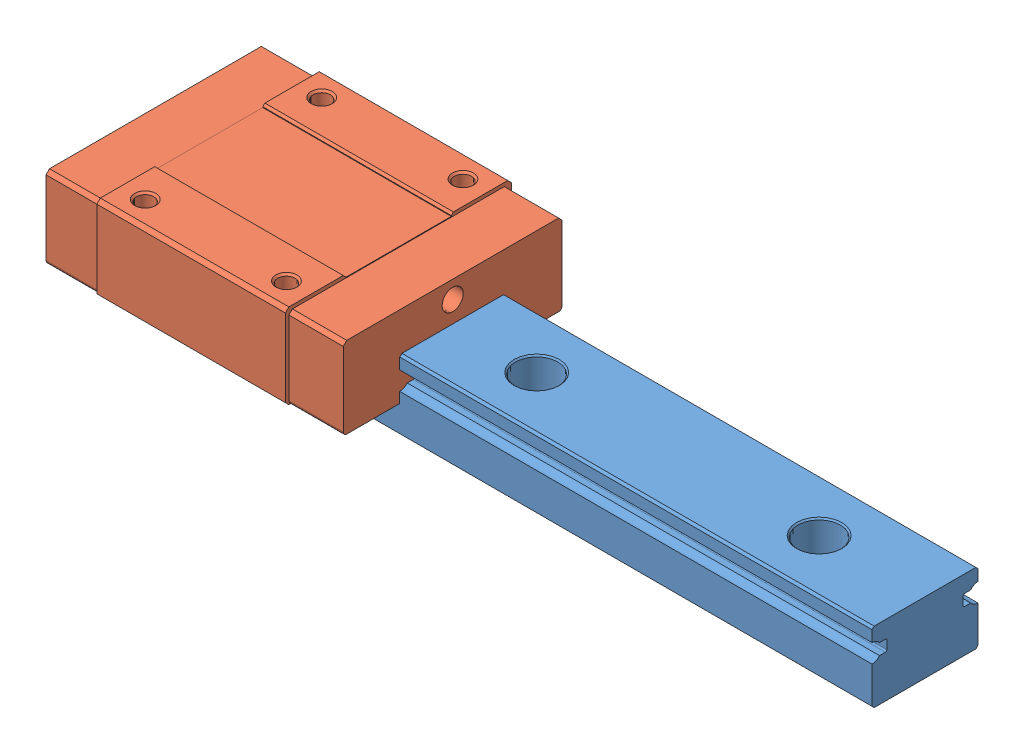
SolidWorks assembly MLN15C.stp.sldasm, configuration 默认 (file format 13000). Lengths in mm.
Overall size (110 16 32).
2 component instances, 2 part files, 0 mates.
Components (placement in the parent):
- MLNR15R110 E=15-1: MLNR15R110 E=15.SLDPRT [默认] at origin size (110 10 15)
- MLN15C-1: MLN15C.SLDPRT [默认] at (1 4 0) size (42.1 12 32)
